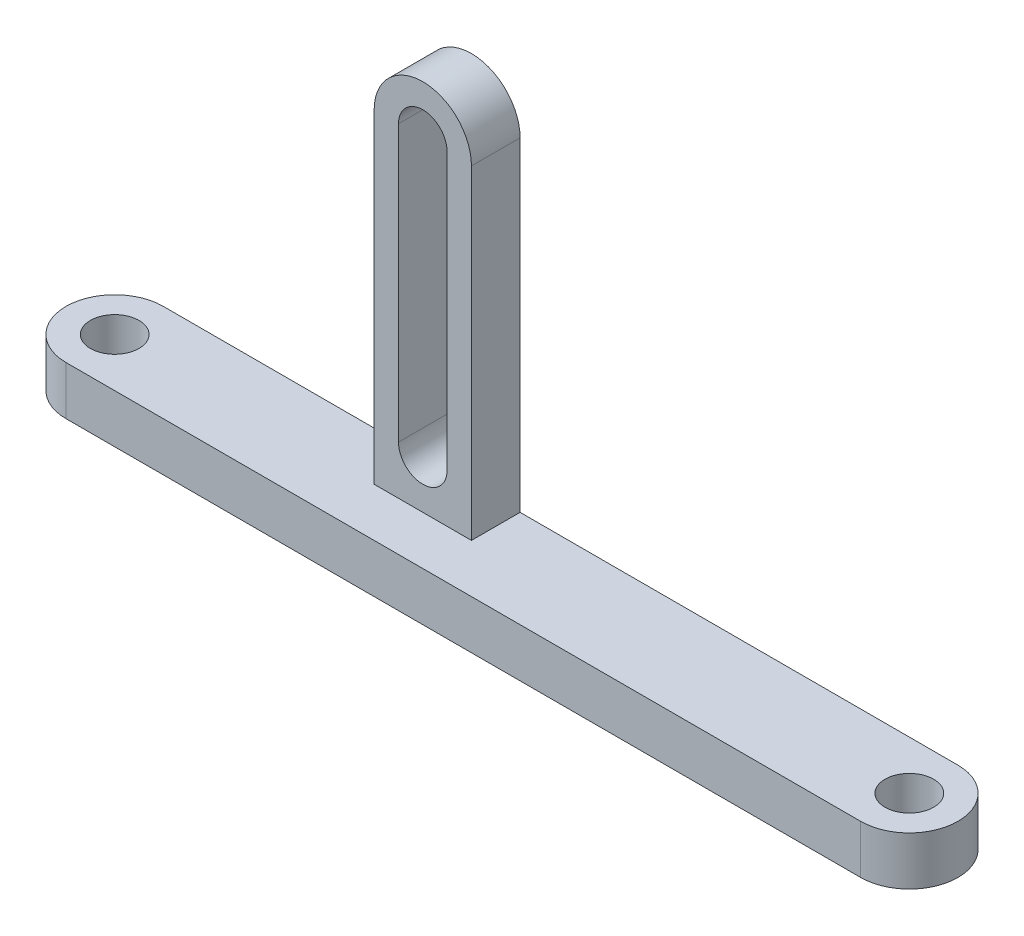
ISO-10303-21;
HEADER;
FILE_DESCRIPTION(('STEP AP214'),'2;1');
FILE_NAME('part.step','',(''),(''),'','','');
FILE_SCHEMA(('AUTOMOTIVE_DESIGN { 1 0 10303 214 1 1 1 1 }'));
ENDSEC;
DATA;
#1=APPLICATION_CONTEXT('core data for automotive mechanical design processes');
#2=APPLICATION_PROTOCOL_DEFINITION('international standard','automotive_design',2000,#1);
#3=PRODUCT_CONTEXT('',#1,'mechanical');
#4=PRODUCT('Part','Part','',(#3));
#5=PRODUCT_RELATED_PRODUCT_CATEGORY('part','',(#4));
#6=PRODUCT_DEFINITION_FORMATION('','',#4);
#7=PRODUCT_DEFINITION_CONTEXT('part definition',#1,'design');
#8=PRODUCT_DEFINITION('design','',#6,#7);
#9=PRODUCT_DEFINITION_SHAPE('','',#8);
#10=(LENGTH_UNIT() NAMED_UNIT(*) SI_UNIT(.MILLI.,.METRE.));
#11=(NAMED_UNIT(*) PLANE_ANGLE_UNIT() SI_UNIT($,.RADIAN.));
#12=(NAMED_UNIT(*) SI_UNIT($,.STERADIAN.) SOLID_ANGLE_UNIT());
#13=UNCERTAINTY_MEASURE_WITH_UNIT(LENGTH_MEASURE(1.E-05),#10,'distance_accuracy_value','');
#14=(GEOMETRIC_REPRESENTATION_CONTEXT(3) GLOBAL_UNCERTAINTY_ASSIGNED_CONTEXT((#13)) GLOBAL_UNIT_ASSIGNED_CONTEXT((#10,
#11,#12)) REPRESENTATION_CONTEXT('',''));
#15=CARTESIAN_POINT('',(0.,0.,0.));
#16=DIRECTION('',(0.,0.,1.));
#17=DIRECTION('',(1.,0.,0.));
#18=AXIS2_PLACEMENT_3D('',#15,#16,#17);
#19=CARTESIAN_POINT('',(-3.,0.,3.));
#20=DIRECTION('',(1.,0.,0.));
#21=DIRECTION('',(0.,1.,0.));
#22=AXIS2_PLACEMENT_3D('',#19,#20,#21);
#23=PLANE('',#22);
#24=DIRECTION('',(0.,-1.,0.));
#25=VECTOR('',#24,1.);
#26=CARTESIAN_POINT('',(-3.,0.,0.));
#27=LINE('',#26,#25);
#28=CARTESIAN_POINT('',(-3.,17.,0.));
#29=VERTEX_POINT('',#28);
#30=CARTESIAN_POINT('',(-3.,-3.,0.));
#31=VERTEX_POINT('',#30);
#32=EDGE_CURVE('E168',#29,#31,#27,.T.);
#33=ORIENTED_EDGE('',*,*,#32,.T.);
#34=DIRECTION('',(0.,0.,-1.));
#35=VECTOR('',#34,1.);
#36=CARTESIAN_POINT('',(-2.99999999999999,-3.,3.));
#37=LINE('',#36,#35);
#38=CARTESIAN_POINT('',(-2.99999999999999,-3.,3.));
#39=VERTEX_POINT('',#38);
#40=EDGE_CURVE('E11',#39,#31,#37,.T.);
#41=ORIENTED_EDGE('',*,*,#40,.F.);
#42=DIRECTION('',(0.,-1.,0.));
#43=VECTOR('',#42,1.);
#44=CARTESIAN_POINT('',(-3.,0.,3.));
#45=LINE('',#44,#43);
#46=CARTESIAN_POINT('',(-3.,17.,3.));
#47=VERTEX_POINT('',#46);
#48=EDGE_CURVE('E118',#47,#39,#45,.T.);
#49=ORIENTED_EDGE('',*,*,#48,.F.);
#50=DIRECTION('',(0.,0.,-1.));
#51=VECTOR('',#50,1.);
#52=CARTESIAN_POINT('',(-3.,17.,3.));
#53=LINE('',#52,#51);
#54=EDGE_CURVE('E139',#47,#29,#53,.T.);
#55=ORIENTED_EDGE('',*,*,#54,.T.);
#56=EDGE_LOOP('',(#33,#41,#49,#55));
#57=FACE_BOUND('',#56,.T.);
#58=ADVANCED_FACE('F41',(#57),#23,.F.);
#59=CARTESIAN_POINT('',(3.,0.,3.));
#60=DIRECTION('',(1.,0.,0.));
#61=DIRECTION('',(0.,1.,0.));
#62=AXIS2_PLACEMENT_3D('',#59,#60,#61);
#63=PLANE('',#62);
#64=DIRECTION('',(0.,-1.,0.));
#65=VECTOR('',#64,1.);
#66=CARTESIAN_POINT('',(3.,0.,0.));
#67=LINE('',#66,#65);
#68=CARTESIAN_POINT('',(3.,17.,0.));
#69=VERTEX_POINT('',#68);
#70=CARTESIAN_POINT('',(3.,-3.,0.));
#71=VERTEX_POINT('',#70);
#72=EDGE_CURVE('E165',#69,#71,#67,.T.);
#73=ORIENTED_EDGE('',*,*,#72,.F.);
#74=DIRECTION('',(0.,0.,-1.));
#75=VECTOR('',#74,1.);
#76=CARTESIAN_POINT('',(3.,17.,3.));
#77=LINE('',#76,#75);
#78=CARTESIAN_POINT('',(3.,17.,3.));
#79=VERTEX_POINT('',#78);
#80=EDGE_CURVE('E87',#79,#69,#77,.T.);
#81=ORIENTED_EDGE('',*,*,#80,.F.);
#82=DIRECTION('',(0.,-1.,0.));
#83=VECTOR('',#82,1.);
#84=CARTESIAN_POINT('',(3.,0.,3.));
#85=LINE('',#84,#83);
#86=CARTESIAN_POINT('',(3.,-3.,3.));
#87=VERTEX_POINT('',#86);
#88=EDGE_CURVE('E116',#79,#87,#85,.T.);
#89=ORIENTED_EDGE('',*,*,#88,.T.);
#90=DIRECTION('',(0.,0.,-1.));
#91=VECTOR('',#90,1.);
#92=CARTESIAN_POINT('',(3.,-3.,3.));
#93=LINE('',#92,#91);
#94=EDGE_CURVE('E52',#87,#71,#93,.T.);
#95=ORIENTED_EDGE('',*,*,#94,.T.);
#96=EDGE_LOOP('',(#73,#81,#89,#95));
#97=FACE_BOUND('',#96,.T.);
#98=ADVANCED_FACE('F126',(#97),#63,.T.);
#99=CARTESIAN_POINT('',(0.,17.,3.));
#100=DIRECTION('',(0.,0.,-1.));
#101=DIRECTION('',(-1.,0.,0.));
#102=AXIS2_PLACEMENT_3D('',#99,#100,#101);
#103=CYLINDRICAL_SURFACE('',#102,1.5);
#104=CARTESIAN_POINT('',(0.,17.,0.));
#105=DIRECTION('',(0.,0.,1.));
#106=DIRECTION('',(1.,0.,0.));
#107=AXIS2_PLACEMENT_3D('',#104,#105,#106);
#108=CIRCLE('',#107,1.5);
#109=CARTESIAN_POINT('',(1.5,17.,0.));
#110=VERTEX_POINT('',#109);
#111=CARTESIAN_POINT('',(-1.5,17.,0.));
#112=VERTEX_POINT('',#111);
#113=EDGE_CURVE('E183',#110,#112,#108,.T.);
#114=ORIENTED_EDGE('',*,*,#113,.F.);
#115=DIRECTION('',(0.,0.,-1.));
#116=VECTOR('',#115,1.);
#117=CARTESIAN_POINT('',(1.5,17.,3.));
#118=LINE('',#117,#116);
#119=CARTESIAN_POINT('',(1.5,17.,3.));
#120=VERTEX_POINT('',#119);
#121=EDGE_CURVE('E45',#120,#110,#118,.T.);
#122=ORIENTED_EDGE('',*,*,#121,.F.);
#123=CARTESIAN_POINT('',(0.,17.,3.));
#124=DIRECTION('',(0.,0.,1.));
#125=DIRECTION('',(1.,0.,0.));
#126=AXIS2_PLACEMENT_3D('',#123,#124,#125);
#127=CIRCLE('',#126,1.5);
#128=CARTESIAN_POINT('',(-1.5,17.,3.));
#129=VERTEX_POINT('',#128);
#130=EDGE_CURVE('E164',#120,#129,#127,.T.);
#131=ORIENTED_EDGE('',*,*,#130,.T.);
#132=DIRECTION('',(0.,0.,-1.));
#133=VECTOR('',#132,1.);
#134=CARTESIAN_POINT('',(-1.5,17.,3.));
#135=LINE('',#134,#133);
#136=EDGE_CURVE('E143',#129,#112,#135,.T.);
#137=ORIENTED_EDGE('',*,*,#136,.T.);
#138=EDGE_LOOP('',(#114,#122,#131,#137));
#139=FACE_BOUND('',#138,.T.);
#140=ADVANCED_FACE('F43',(#139),#103,.F.);
#141=CARTESIAN_POINT('',(1.5,0.,3.));
#142=DIRECTION('',(-1.,0.,0.));
#143=DIRECTION('',(0.,0.,1.));
#144=AXIS2_PLACEMENT_3D('',#141,#142,#143);
#145=PLANE('',#144);
#146=DIRECTION('',(0.,1.,0.));
#147=VECTOR('',#146,1.);
#148=CARTESIAN_POINT('',(1.5,0.,0.));
#149=LINE('',#148,#147);
#150=CARTESIAN_POINT('',(1.5,0.,0.));
#151=VERTEX_POINT('',#150);
#152=EDGE_CURVE('E179',#151,#110,#149,.T.);
#153=ORIENTED_EDGE('',*,*,#152,.F.);
#154=DIRECTION('',(0.,0.,-1.));
#155=VECTOR('',#154,1.);
#156=CARTESIAN_POINT('',(1.5,0.,3.));
#157=LINE('',#156,#155);
#158=CARTESIAN_POINT('',(1.5,0.,3.));
#159=VERTEX_POINT('',#158);
#160=EDGE_CURVE('E148',#159,#151,#157,.T.);
#161=ORIENTED_EDGE('',*,*,#160,.F.);
#162=DIRECTION('',(0.,1.,0.));
#163=VECTOR('',#162,1.);
#164=CARTESIAN_POINT('',(1.5,0.,3.));
#165=LINE('',#164,#163);
#166=EDGE_CURVE('E198',#159,#120,#165,.T.);
#167=ORIENTED_EDGE('',*,*,#166,.T.);
#168=ORIENTED_EDGE('',*,*,#121,.T.);
#169=EDGE_LOOP('',(#153,#161,#167,#168));
#170=FACE_BOUND('',#169,.T.);
#171=ADVANCED_FACE('F301',(#170),#145,.T.);
#172=CARTESIAN_POINT('',(0.,0.,3.));
#173=DIRECTION('',(0.,0.,-1.));
#174=DIRECTION('',(-1.,0.,0.));
#175=AXIS2_PLACEMENT_3D('',#172,#173,#174);
#176=CYLINDRICAL_SURFACE('',#175,1.5);
#177=CARTESIAN_POINT('',(0.,0.,0.));
#178=DIRECTION('',(0.,0.,1.));
#179=DIRECTION('',(1.,0.,0.));
#180=AXIS2_PLACEMENT_3D('',#177,#178,#179);
#181=CIRCLE('',#180,1.5);
#182=CARTESIAN_POINT('',(-1.5,0.,0.));
#183=VERTEX_POINT('',#182);
#184=EDGE_CURVE('E175',#183,#151,#181,.T.);
#185=ORIENTED_EDGE('',*,*,#184,.F.);
#186=DIRECTION('',(0.,0.,-1.));
#187=VECTOR('',#186,1.);
#188=CARTESIAN_POINT('',(-1.5,0.,3.));
#189=LINE('',#188,#187);
#190=CARTESIAN_POINT('',(-1.5,0.,3.));
#191=VERTEX_POINT('',#190);
#192=EDGE_CURVE('E146',#191,#183,#189,.T.);
#193=ORIENTED_EDGE('',*,*,#192,.F.);
#194=CARTESIAN_POINT('',(0.,0.,3.));
#195=DIRECTION('',(0.,0.,1.));
#196=DIRECTION('',(1.,0.,0.));
#197=AXIS2_PLACEMENT_3D('',#194,#195,#196);
#198=CIRCLE('',#197,1.5);
#199=EDGE_CURVE('E195',#191,#159,#198,.T.);
#200=ORIENTED_EDGE('',*,*,#199,.T.);
#201=ORIENTED_EDGE('',*,*,#160,.T.);
#202=EDGE_LOOP('',(#185,#193,#200,#201));
#203=FACE_BOUND('',#202,.T.);
#204=ADVANCED_FACE('F298',(#203),#176,.F.);
#205=CARTESIAN_POINT('',(-1.5,0.,3.));
#206=DIRECTION('',(-1.,0.,0.));
#207=DIRECTION('',(0.,0.,1.));
#208=AXIS2_PLACEMENT_3D('',#205,#206,#207);
#209=PLANE('',#208);
#210=DIRECTION('',(0.,1.,0.));
#211=VECTOR('',#210,1.);
#212=CARTESIAN_POINT('',(-1.5,0.,0.));
#213=LINE('',#212,#211);
#214=EDGE_CURVE('E171',#183,#112,#213,.T.);
#215=ORIENTED_EDGE('',*,*,#214,.T.);
#216=ORIENTED_EDGE('',*,*,#136,.F.);
#217=DIRECTION('',(0.,1.,0.));
#218=VECTOR('',#217,1.);
#219=CARTESIAN_POINT('',(-1.5,0.,3.));
#220=LINE('',#219,#218);
#221=EDGE_CURVE('E192',#191,#129,#220,.T.);
#222=ORIENTED_EDGE('',*,*,#221,.F.);
#223=ORIENTED_EDGE('',*,*,#192,.T.);
#224=EDGE_LOOP('',(#215,#216,#222,#223));
#225=FACE_BOUND('',#224,.T.);
#226=ADVANCED_FACE('F294',(#225),#209,.F.);
#227=CARTESIAN_POINT('',(0.,17.,3.));
#228=DIRECTION('',(0.,0.,-1.));
#229=DIRECTION('',(-1.,0.,0.));
#230=AXIS2_PLACEMENT_3D('',#227,#228,#229);
#231=CYLINDRICAL_SURFACE('',#230,3.);
#232=CARTESIAN_POINT('',(0.,17.,0.));
#233=DIRECTION('',(0.,0.,1.));
#234=DIRECTION('',(1.,0.,0.));
#235=AXIS2_PLACEMENT_3D('',#232,#233,#234);
#236=CIRCLE('',#235,3.);
#237=EDGE_CURVE('E90',#69,#29,#236,.T.);
#238=ORIENTED_EDGE('',*,*,#237,.T.);
#239=ORIENTED_EDGE('',*,*,#54,.F.);
#240=CARTESIAN_POINT('',(0.,17.,3.));
#241=DIRECTION('',(0.,0.,1.));
#242=DIRECTION('',(1.,0.,0.));
#243=AXIS2_PLACEMENT_3D('',#240,#241,#242);
#244=CIRCLE('',#243,3.);
#245=EDGE_CURVE('E61',#79,#47,#244,.T.);
#246=ORIENTED_EDGE('',*,*,#245,.F.);
#247=ORIENTED_EDGE('',*,*,#80,.T.);
#248=EDGE_LOOP('',(#238,#239,#246,#247));
#249=FACE_BOUND('',#248,.T.);
#250=ADVANCED_FACE('F297',(#249),#231,.T.);
#251=CARTESIAN_POINT('',(0.,0.,3.));
#252=DIRECTION('',(0.,0.,1.));
#253=DIRECTION('',(1.,0.,0.));
#254=AXIS2_PLACEMENT_3D('',#251,#252,#253);
#255=PLANE('',#254);
#256=ORIENTED_EDGE('',*,*,#130,.F.);
#257=ORIENTED_EDGE('',*,*,#166,.F.);
#258=ORIENTED_EDGE('',*,*,#199,.F.);
#259=ORIENTED_EDGE('',*,*,#221,.T.);
#260=EDGE_LOOP('',(#256,#257,#258,#259));
#261=FACE_BOUND('',#260,.T.);
#262=ORIENTED_EDGE('',*,*,#48,.T.);
#263=DIRECTION('',(1.,0.,0.));
#264=VECTOR('',#263,1.);
#265=CARTESIAN_POINT('',(0.,-3.,3.));
#266=LINE('',#265,#264);
#267=EDGE_CURVE('E113',#39,#87,#266,.T.);
#268=ORIENTED_EDGE('',*,*,#267,.T.);
#269=ORIENTED_EDGE('',*,*,#88,.F.);
#270=ORIENTED_EDGE('',*,*,#245,.T.);
#271=EDGE_LOOP('',(#262,#268,#269,#270));
#272=FACE_BOUND('',#271,.T.);
#273=ADVANCED_FACE('F115',(#261,#272),#255,.T.);
#274=CARTESIAN_POINT('',(0.,0.,0.));
#275=DIRECTION('',(0.,0.,1.));
#276=DIRECTION('',(1.,0.,0.));
#277=AXIS2_PLACEMENT_3D('',#274,#275,#276);
#278=PLANE('',#277);
#279=ORIENTED_EDGE('',*,*,#113,.T.);
#280=ORIENTED_EDGE('',*,*,#214,.F.);
#281=ORIENTED_EDGE('',*,*,#184,.T.);
#282=ORIENTED_EDGE('',*,*,#152,.T.);
#283=EDGE_LOOP('',(#279,#280,#281,#282));
#284=FACE_BOUND('',#283,.T.);
#285=ORIENTED_EDGE('',*,*,#32,.F.);
#286=ORIENTED_EDGE('',*,*,#237,.F.);
#287=ORIENTED_EDGE('',*,*,#72,.T.);
#288=DIRECTION('',(1.,0.,0.));
#289=VECTOR('',#288,1.);
#290=CARTESIAN_POINT('',(-19.,-3.,0.));
#291=LINE('',#290,#289);
#292=CARTESIAN_POINT('',(30.,-2.99999999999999,0.));
#293=VERTEX_POINT('',#292);
#294=EDGE_CURVE('E135',#71,#293,#291,.T.);
#295=ORIENTED_EDGE('',*,*,#294,.T.);
#296=DIRECTION('',(0.,1.,0.));
#297=VECTOR('',#296,1.);
#298=CARTESIAN_POINT('',(30.,-5.99999999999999,0.));
#299=LINE('',#298,#297);
#300=CARTESIAN_POINT('',(30.,-5.99999999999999,0.));
#301=VERTEX_POINT('',#300);
#302=EDGE_CURVE('E206',#301,#293,#299,.T.);
#303=ORIENTED_EDGE('',*,*,#302,.F.);
#304=DIRECTION('',(1.,0.,0.));
#305=VECTOR('',#304,1.);
#306=CARTESIAN_POINT('',(-19.,-6.,0.));
#307=LINE('',#306,#305);
#308=CARTESIAN_POINT('',(-19.,-6.,0.));
#309=VERTEX_POINT('',#308);
#310=EDGE_CURVE('E244',#309,#301,#307,.T.);
#311=ORIENTED_EDGE('',*,*,#310,.F.);
#312=DIRECTION('',(0.,1.,0.));
#313=VECTOR('',#312,1.);
#314=CARTESIAN_POINT('',(-19.,-6.,0.));
#315=LINE('',#314,#313);
#316=CARTESIAN_POINT('',(-19.,-3.,0.));
#317=VERTEX_POINT('',#316);
#318=EDGE_CURVE('E187',#309,#317,#315,.T.);
#319=ORIENTED_EDGE('',*,*,#318,.T.);
#320=EDGE_CURVE('E228',#317,#31,#291,.T.);
#321=ORIENTED_EDGE('',*,*,#320,.T.);
#322=EDGE_LOOP('',(#285,#286,#287,#295,#303,#311,#319,#321));
#323=FACE_BOUND('',#322,.T.);
#324=ADVANCED_FACE('F272',(#284,#323),#278,.F.);
#325=CARTESIAN_POINT('',(-19.,-6.,3.));
#326=DIRECTION('',(0.,-1.,0.));
#327=DIRECTION('',(1.,0.,0.));
#328=AXIS2_PLACEMENT_3D('',#325,#326,#327);
#329=PLANE('',#328);
#330=CARTESIAN_POINT('',(-19.,-6.,3.));
#331=DIRECTION('',(0.,-1.,0.));
#332=DIRECTION('',(1.,0.,0.));
#333=AXIS2_PLACEMENT_3D('',#330,#331,#332);
#334=CIRCLE('',#333,1.5);
#335=CARTESIAN_POINT('',(-17.5,-6.,3.));
#336=VERTEX_POINT('',#335);
#337=EDGE_CURVE('E236',#336,#336,#334,.T.);
#338=ORIENTED_EDGE('',*,*,#337,.F.);
#339=EDGE_LOOP('',(#338));
#340=FACE_BOUND('',#339,.T.);
#341=CARTESIAN_POINT('',(-19.,-6.,3.));
#342=DIRECTION('',(0.,-1.,0.));
#343=DIRECTION('',(1.,0.,0.));
#344=AXIS2_PLACEMENT_3D('',#341,#342,#343);
#345=CIRCLE('',#344,3.);
#346=CARTESIAN_POINT('',(-19.,-6.,6.));
#347=VERTEX_POINT('',#346);
#348=EDGE_CURVE('E223',#347,#309,#345,.T.);
#349=ORIENTED_EDGE('',*,*,#348,.T.);
#350=ORIENTED_EDGE('',*,*,#310,.T.);
#351=CARTESIAN_POINT('',(30.,-5.99999999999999,3.00000000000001));
#352=DIRECTION('',(0.,-1.,0.));
#353=DIRECTION('',(1.,0.,0.));
#354=AXIS2_PLACEMENT_3D('',#351,#352,#353);
#355=CIRCLE('',#354,3.);
#356=CARTESIAN_POINT('',(30.,-5.99999999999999,6.00000000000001));
#357=VERTEX_POINT('',#356);
#358=EDGE_CURVE('E240',#301,#357,#355,.T.);
#359=ORIENTED_EDGE('',*,*,#358,.T.);
#360=DIRECTION('',(-1.,0.,0.));
#361=VECTOR('',#360,1.);
#362=CARTESIAN_POINT('',(-19.,-6.,6.));
#363=LINE('',#362,#361);
#364=EDGE_CURVE('E218',#357,#347,#363,.T.);
#365=ORIENTED_EDGE('',*,*,#364,.T.);
#366=EDGE_LOOP('',(#349,#350,#359,#365));
#367=FACE_BOUND('',#366,.T.);
#368=CARTESIAN_POINT('',(30.,-5.99999999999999,3.00000000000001));
#369=DIRECTION('',(0.,-1.,0.));
#370=DIRECTION('',(1.,0.,0.));
#371=AXIS2_PLACEMENT_3D('',#368,#369,#370);
#372=CIRCLE('',#371,1.5);
#373=CARTESIAN_POINT('',(31.5,-5.99999999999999,3.00000000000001));
#374=VERTEX_POINT('',#373);
#375=EDGE_CURVE('E255',#374,#374,#372,.T.);
#376=ORIENTED_EDGE('',*,*,#375,.F.);
#377=EDGE_LOOP('',(#376));
#378=FACE_BOUND('',#377,.T.);
#379=ADVANCED_FACE('F270',(#340,#367,#378),#329,.T.);
#380=CARTESIAN_POINT('',(-19.,-3.,3.));
#381=DIRECTION('',(0.,-1.,0.));
#382=DIRECTION('',(1.,0.,0.));
#383=AXIS2_PLACEMENT_3D('',#380,#381,#382);
#384=PLANE('',#383);
#385=ORIENTED_EDGE('',*,*,#94,.F.);
#386=ORIENTED_EDGE('',*,*,#267,.F.);
#387=ORIENTED_EDGE('',*,*,#40,.T.);
#388=ORIENTED_EDGE('',*,*,#320,.F.);
#389=CARTESIAN_POINT('',(-19.,-3.,3.));
#390=DIRECTION('',(0.,-1.,0.));
#391=DIRECTION('',(1.,0.,0.));
#392=AXIS2_PLACEMENT_3D('',#389,#390,#391);
#393=CIRCLE('',#392,3.);
#394=CARTESIAN_POINT('',(-19.,-3.,6.));
#395=VERTEX_POINT('',#394);
#396=EDGE_CURVE('E232',#395,#317,#393,.T.);
#397=ORIENTED_EDGE('',*,*,#396,.F.);
#398=DIRECTION('',(-1.,0.,0.));
#399=VECTOR('',#398,1.);
#400=CARTESIAN_POINT('',(-19.,-3.,6.));
#401=LINE('',#400,#399);
#402=CARTESIAN_POINT('',(30.,-2.99999999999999,6.00000000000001));
#403=VERTEX_POINT('',#402);
#404=EDGE_CURVE('E219',#403,#395,#401,.T.);
#405=ORIENTED_EDGE('',*,*,#404,.F.);
#406=CARTESIAN_POINT('',(30.,-2.99999999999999,3.00000000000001));
#407=DIRECTION('',(0.,-1.,0.));
#408=DIRECTION('',(1.,0.,0.));
#409=AXIS2_PLACEMENT_3D('',#406,#407,#408);
#410=CIRCLE('',#409,3.);
#411=EDGE_CURVE('E224',#293,#403,#410,.T.);
#412=ORIENTED_EDGE('',*,*,#411,.F.);
#413=ORIENTED_EDGE('',*,*,#294,.F.);
#414=EDGE_LOOP('',(#385,#386,#387,#388,#397,#405,#412,#413));
#415=FACE_BOUND('',#414,.T.);
#416=CARTESIAN_POINT('',(-19.,-3.,3.));
#417=DIRECTION('',(0.,-1.,0.));
#418=DIRECTION('',(1.,0.,0.));
#419=AXIS2_PLACEMENT_3D('',#416,#417,#418);
#420=CIRCLE('',#419,1.5);
#421=CARTESIAN_POINT('',(-17.5,-3.,3.));
#422=VERTEX_POINT('',#421);
#423=EDGE_CURVE('E251',#422,#422,#420,.T.);
#424=ORIENTED_EDGE('',*,*,#423,.T.);
#425=EDGE_LOOP('',(#424));
#426=FACE_BOUND('',#425,.T.);
#427=CARTESIAN_POINT('',(30.,-2.99999999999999,3.00000000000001));
#428=DIRECTION('',(0.,-1.,0.));
#429=DIRECTION('',(1.,0.,0.));
#430=AXIS2_PLACEMENT_3D('',#427,#428,#429);
#431=CIRCLE('',#430,1.5);
#432=CARTESIAN_POINT('',(31.5,-2.99999999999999,3.00000000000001));
#433=VERTEX_POINT('',#432);
#434=EDGE_CURVE('E259',#433,#433,#431,.T.);
#435=ORIENTED_EDGE('',*,*,#434,.T.);
#436=EDGE_LOOP('',(#435));
#437=FACE_BOUND('',#436,.T.);
#438=ADVANCED_FACE('F131',(#415,#426,#437),#384,.F.);
#439=CARTESIAN_POINT('',(-19.,-6.,3.));
#440=DIRECTION('',(0.,1.,0.));
#441=DIRECTION('',(-1.,0.,0.));
#442=AXIS2_PLACEMENT_3D('',#439,#440,#441);
#443=CYLINDRICAL_SURFACE('',#442,3.);
#444=ORIENTED_EDGE('',*,*,#396,.T.);
#445=ORIENTED_EDGE('',*,*,#318,.F.);
#446=ORIENTED_EDGE('',*,*,#348,.F.);
#447=DIRECTION('',(0.,1.,0.));
#448=VECTOR('',#447,1.);
#449=CARTESIAN_POINT('',(-19.,-6.,6.));
#450=LINE('',#449,#448);
#451=EDGE_CURVE('E214',#347,#395,#450,.T.);
#452=ORIENTED_EDGE('',*,*,#451,.T.);
#453=EDGE_LOOP('',(#444,#445,#446,#452));
#454=FACE_BOUND('',#453,.T.);
#455=ADVANCED_FACE('F279',(#454),#443,.T.);
#456=CARTESIAN_POINT('',(30.,-5.99999999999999,3.00000000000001));
#457=DIRECTION('',(0.,1.,0.));
#458=DIRECTION('',(-1.,0.,0.));
#459=AXIS2_PLACEMENT_3D('',#456,#457,#458);
#460=CYLINDRICAL_SURFACE('',#459,3.);
#461=ORIENTED_EDGE('',*,*,#411,.T.);
#462=DIRECTION('',(0.,1.,0.));
#463=VECTOR('',#462,1.);
#464=CARTESIAN_POINT('',(30.,-5.99999999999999,6.00000000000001));
#465=LINE('',#464,#463);
#466=EDGE_CURVE('E210',#357,#403,#465,.T.);
#467=ORIENTED_EDGE('',*,*,#466,.F.);
#468=ORIENTED_EDGE('',*,*,#358,.F.);
#469=ORIENTED_EDGE('',*,*,#302,.T.);
#470=EDGE_LOOP('',(#461,#467,#468,#469));
#471=FACE_BOUND('',#470,.T.);
#472=ADVANCED_FACE('F321',(#471),#460,.T.);
#473=CARTESIAN_POINT('',(-19.,-6.,6.));
#474=DIRECTION('',(0.,0.,-1.));
#475=DIRECTION('',(-1.,0.,0.));
#476=AXIS2_PLACEMENT_3D('',#473,#474,#475);
#477=PLANE('',#476);
#478=ORIENTED_EDGE('',*,*,#404,.T.);
#479=ORIENTED_EDGE('',*,*,#451,.F.);
#480=ORIENTED_EDGE('',*,*,#364,.F.);
#481=ORIENTED_EDGE('',*,*,#466,.T.);
#482=EDGE_LOOP('',(#478,#479,#480,#481));
#483=FACE_BOUND('',#482,.T.);
#484=ADVANCED_FACE('F325',(#483),#477,.F.);
#485=CARTESIAN_POINT('',(-19.,-6.,3.));
#486=DIRECTION('',(0.,1.,0.));
#487=DIRECTION('',(-1.,0.,0.));
#488=AXIS2_PLACEMENT_3D('',#485,#486,#487);
#489=CYLINDRICAL_SURFACE('',#488,1.5);
#490=ORIENTED_EDGE('',*,*,#337,.T.);
#491=EDGE_LOOP('',(#490));
#492=FACE_BOUND('',#491,.T.);
#493=ORIENTED_EDGE('',*,*,#423,.F.);
#494=EDGE_LOOP('',(#493));
#495=FACE_BOUND('',#494,.T.);
#496=ADVANCED_FACE('F328',(#492,#495),#489,.F.);
#497=CARTESIAN_POINT('',(30.,-5.99999999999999,3.00000000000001));
#498=DIRECTION('',(0.,1.,0.));
#499=DIRECTION('',(-1.,0.,0.));
#500=AXIS2_PLACEMENT_3D('',#497,#498,#499);
#501=CYLINDRICAL_SURFACE('',#500,1.5);
#502=ORIENTED_EDGE('',*,*,#375,.T.);
#503=EDGE_LOOP('',(#502));
#504=FACE_BOUND('',#503,.T.);
#505=ORIENTED_EDGE('',*,*,#434,.F.);
#506=EDGE_LOOP('',(#505));
#507=FACE_BOUND('',#506,.T.);
#508=ADVANCED_FACE('F267',(#504,#507),#501,.F.);
#509=CLOSED_SHELL('',(#58,#98,#140,#171,#204,#226,#250,#273,#324,#379,#438,#455,#472,#484,#496,#508));
#510=MANIFOLD_SOLID_BREP('B2',#509);
#511=ADVANCED_BREP_SHAPE_REPRESENTATION('',(#18,#510),#14);
#512=SHAPE_DEFINITION_REPRESENTATION(#9,#511);
ENDSEC;
END-ISO-10303-21;
